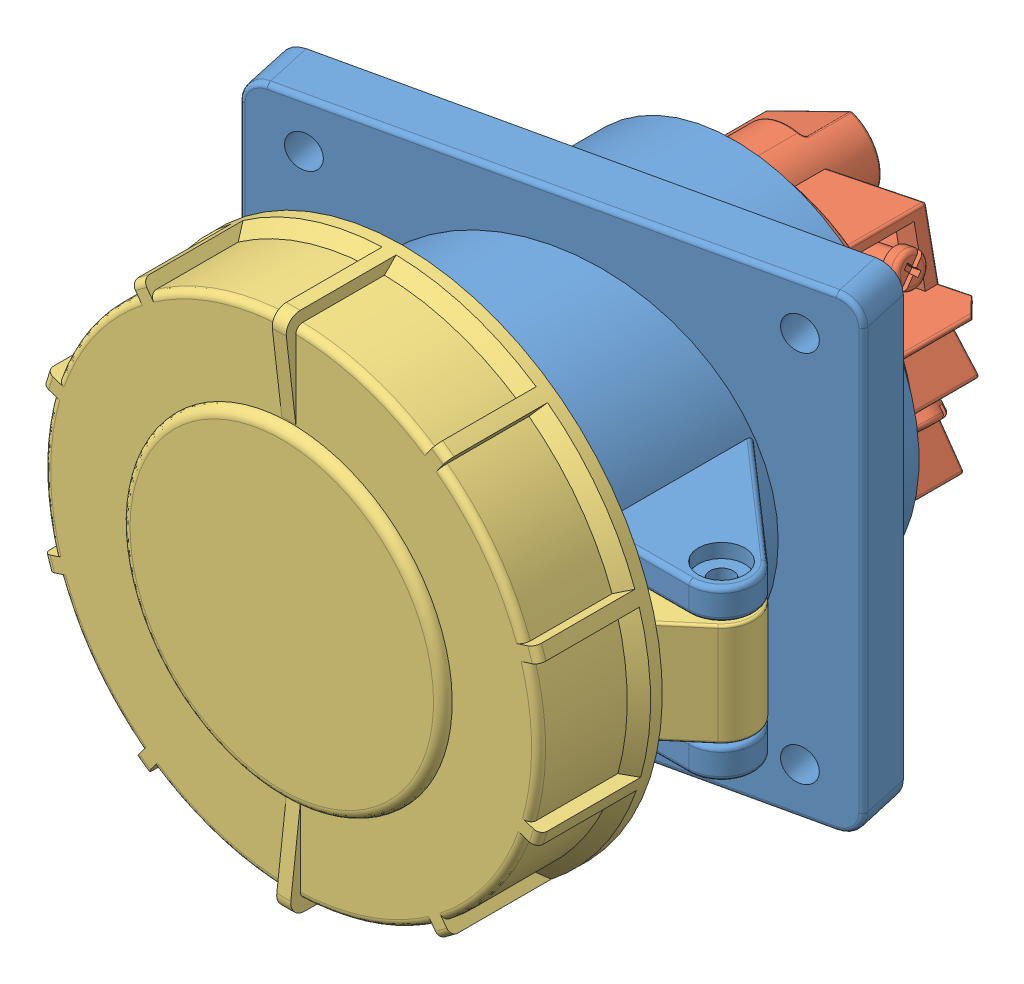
SolidWorks assembly Розетка стационарная внутренняя угловая ps-4352-63-380.SLDASM, configuration По умолчанию (file format 10000). Lengths in mm.
Overall size (119.46 111.32 132.3).
3 component instances, 3 part files, 5 mates.
Components (placement in the parent):
- Корпус 4352,4342-1: Корпус 4352,4342.SLDPRT [По умолчанию] at (95.6565 61.1654 6.6269) size (119.46 100 82)
- Колодка 3352,4352-1: Колодка 3352,4352.SLDPRT [По умолчанию] at (95.6565 61.1654 6.6269) x (0.687352 0.726324 0) z (0 0 -1) size (72 72 112.06)
- Крышка 3342, 4342, 3352, 4352-1: Крышка 3342, 4342, 3352, 4352.SLDPRT [По умолчанию] at (95.6565 61.1654 101.6269) x (0 1 0) z (0 0 -1) size (111.32 117.7 46.24)
Mates (geometry in assembly coordinates):
- Концентричный1: concentric aligned: cylinder of Корпус 4352,4342-1 through (95.6565 61.1654 88.6269) axis (0 0 -1) radius 39.5; cylinder of Колодка 3352,4352-1 through (95.6565 61.1654 83.6269) axis (0 0 -1) radius 30
- Совпадение1: coincident anti-aligned: plane of Корпус 4352,4342-1 through (95.6565 61.1654 6.6269) normal (0 0 -1); plane of Колодка 3352,4352-1 through (95.6565 61.1654 6.6269) normal (0 0 1)
- Концентричный2: concentric aligned: cylinder of Корпус 4352,4342-1 through (95.6565 61.1654 88.6269) axis (0 0 -1) radius 39.5; cylinder of Крышка 3342, 4342, 3352, 4352-1 through (95.6565 61.1654 88.6269) axis (0 0 -1) radius 50.5
- Параллельность1: parallel anti-aligned: plane of Корпус 4352,4342-1 through (165.0989 72.6654 27.6269) normal (0 -1 0); plane of Крышка 3342, 4342, 3352, 4352-1 through (150.8563 72.1654 64.6269) normal (0 1 0)
- Совпадение2: coincident anti-aligned: plane of Корпус 4352,4342-1 through (95.6565 61.1654 88.6269) normal (0 0 1); plane of Крышка 3342, 4342, 3352, 4352-1 through (95.6565 61.1654 88.6269) normal (0 0 -1)
